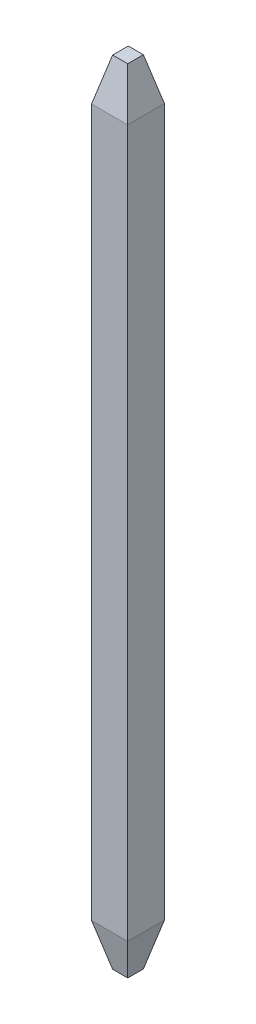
from build123d import *
from OCP.BRepFilletAPI import BRepFilletAPI_MakeChamfer

# Parameters (mm, degrees)
SKETCH1_W      = 0.66
SKETCH1_H      = 14.22
EXTRUDE1_DEPTH = 0.65
CHAMFER1_SIZE  = 0.76
CHAMFER1_SIZE2 = 0.189489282


with BuildPart() as part:
    # Sketch1 → Extrude1 (new body)
    with BuildSketch(Plane(origin=(0, 0, 0), x_dir=(0, 0, -1), z_dir=(1, 0, 0))):
        with Locations((0.33, 7.11)):
            Rectangle(SKETCH1_W, SKETCH1_H)
    extrude(amount=EXTRUDE1_DEPTH)

    # Chamfer1: one chamfer whose edges measure the first distance from different faces: ONE call of the kernel's chamfer builder (chamfer() names one face for all edges)
    chamfer1_edges_1 = [part.edges().sort_by_distance(p)[0] for p in [
        (0.65, 14.22, -0.33),
        (0.65, 0, -0.33),
    ]]
    chamfer1_side_1 = [part.faces().sort_by_distance(p)[0] for p in [
        (0.65, 7.11, -0.33),
    ]]
    chamfer1_edges_2 = [part.edges().sort_by_distance(p)[0] for p in [
        (0, 14.22, -0.33),
        (0, 0, -0.33),
    ]]
    chamfer1_side_2 = [part.faces().sort_by_distance(p)[0] for p in [
        (0, 7.11, -0.33),
    ]]
    chamfer1_edges_3 = [part.edges().sort_by_distance(p)[0] for p in [
        (0.325, 14.22, 0),
        (0.325, 0, 0),
    ]]
    chamfer1_side_3 = [part.faces().sort_by_distance(p)[0] for p in [
        (0.325, 7.11, 0),
    ]]
    chamfer1_edges_4 = [part.edges().sort_by_distance(p)[0] for p in [
        (0.325, 14.22, -0.66),
        (0.325, 0, -0.66),
    ]]
    chamfer1_side_4 = [part.faces().sort_by_distance(p)[0] for p in [
        (0.325, 7.11, -0.66),
    ]]
    chamfer1 = BRepFilletAPI_MakeChamfer(part.part.solid().wrapped)
    for e in chamfer1_edges_1:
        chamfer1.Add(CHAMFER1_SIZE, CHAMFER1_SIZE2, e.wrapped, chamfer1_side_1[0].wrapped)  # the first distance lies on this face
    for e in chamfer1_edges_2:
        chamfer1.Add(CHAMFER1_SIZE, CHAMFER1_SIZE2, e.wrapped, chamfer1_side_2[0].wrapped)  # the first distance lies on this face
    for e in chamfer1_edges_3:
        chamfer1.Add(CHAMFER1_SIZE, CHAMFER1_SIZE2, e.wrapped, chamfer1_side_3[0].wrapped)  # the first distance lies on this face
    for e in chamfer1_edges_4:
        chamfer1.Add(CHAMFER1_SIZE, CHAMFER1_SIZE2, e.wrapped, chamfer1_side_4[0].wrapped)  # the first distance lies on this face
    add(Compound.cast(chamfer1.Shape()), mode=Mode.REPLACE)


solid = part.part
